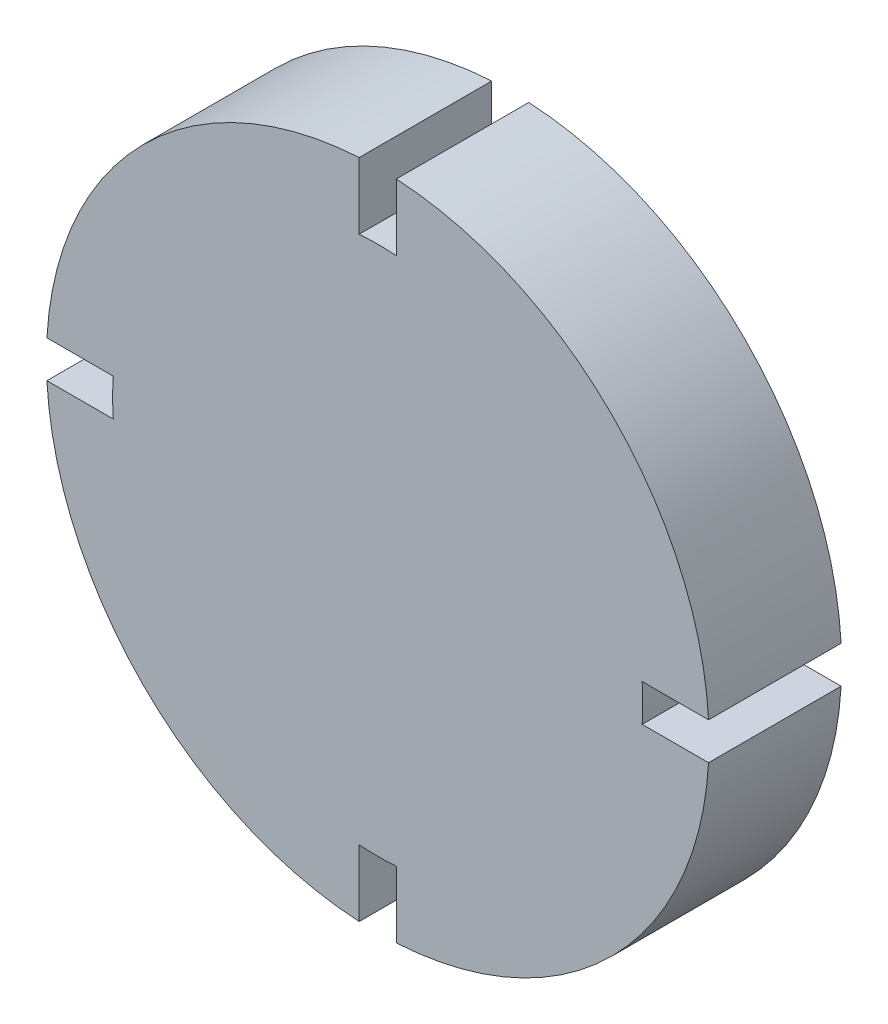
from build123d import *

# Parameters (mm, degrees)
BOSS_EXTRUDE1_DEPTH = 10


with BuildPart() as part:
    # Sketch1 → Boss-Extrude1 (new body)
    with BuildSketch(Plane.XY):
        with BuildLine():
            Line((-1.4, 24.960769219), (-1.4, 19.950939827))
            ThreePointArc((-1.4, 19.950939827), (0, 20), (1.4, 19.950939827))
            Line((1.4, 19.950939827), (1.4, 24.960769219))
            ThreePointArc((1.4, 24.960769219), (17.67766953, 17.67766953), (24.960769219, 1.4))
            Line((24.960769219, 1.4), (19.950939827, 1.4))
            ThreePointArc((19.950939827, 1.4), (20, 0), (19.950939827, -1.4))
            Line((19.950939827, -1.4), (24.960769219, -1.4))
            ThreePointArc((24.960769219, -1.4), (17.67766953, -17.67766953), (1.4, -24.960769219))
            Line((1.4, -24.960769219), (1.4, -19.950939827))
            ThreePointArc((1.4, -19.950939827), (0, -20), (-1.4, -19.950939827))
            Line((-1.4, -19.950939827), (-1.4, -24.960769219))
            ThreePointArc((-1.4, -24.960769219), (-17.67766953, -17.67766953), (-24.960769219, -1.4))
            Line((-24.960769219, -1.4), (-19.950939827, -1.4))
            ThreePointArc((-19.950939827, -1.4), (-20, 0), (-19.950939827, 1.4))
            Line((-19.950939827, 1.4), (-24.960769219, 1.4))
            ThreePointArc((-24.960769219, 1.4), (-17.67766953, 17.67766953), (-1.4, 24.960769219))
        make_face()
    extrude(amount=BOSS_EXTRUDE1_DEPTH)


solid = part.part
